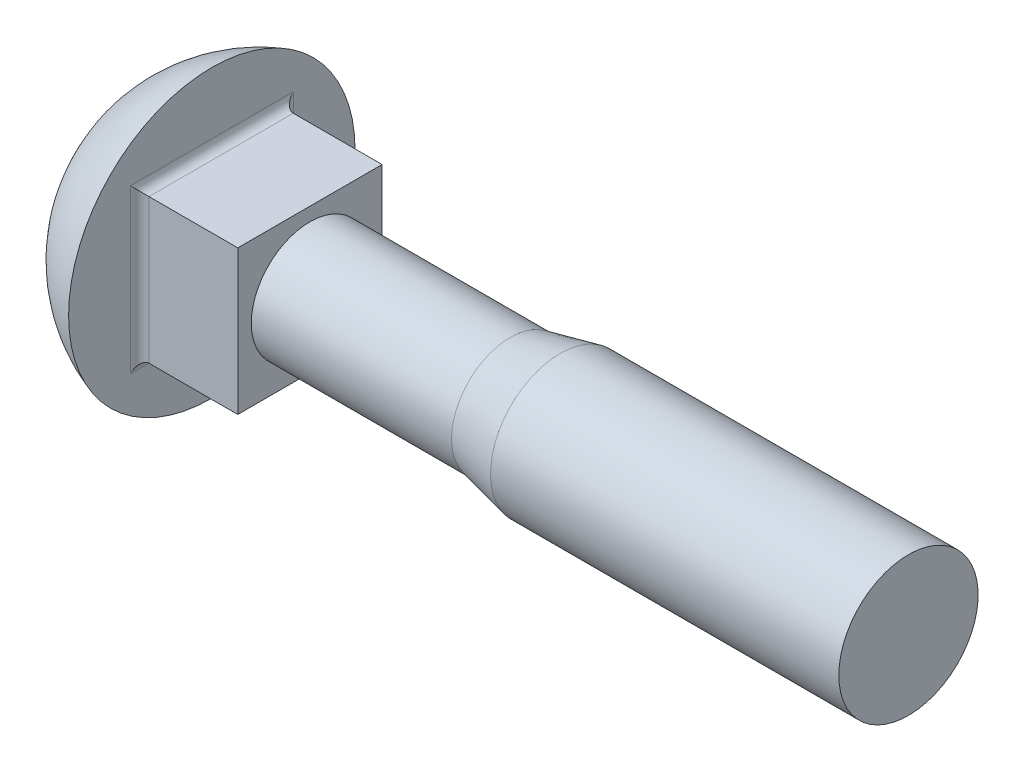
from build123d import *

# Parameters (mm, degrees)
SKETCH2_W    = 12.43
SKETCH2_H    = 12.43
NECK_DEPTH   = 8.45
HEADFILLET_R = 0.8


with BuildPart() as part:
    # Sketch1 → Base (revolve)
    with BuildSketch(Plane.XY, mode=Mode.PRIVATE) as base_sk:
        with BuildLine():
            Line((68.9, 0), (68.9, 6))
            Line((68.9, 6), (8.9, 6))
            Line((8.9, 6), (8.9, 12.336531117))
            ThreePointArc((8.9, 12.336531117), (2.457229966, 7.605918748), (0, 0))
            Line((0, 0), (68.9, 0))
        make_face()
    revolve(base_sk.sketch.rotate(Axis((-31.484345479, 0, 0), (1, 0, 0)), 90), axis=Axis((-31.484345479, 0, 0), (1, 0, 0)))

    # Sketch2 → Neck (add)
    with BuildSketch(Plane(origin=(8.9, 0, 0), x_dir=(0, 0, -1), z_dir=(1, 0, 0))):
        Rectangle(SKETCH2_W, SKETCH2_H)
    extrude(amount=NECK_DEPTH)

    # Sketch5 → Cut-Revolve1 (revolve, cut)
    with BuildSketch(Plane.XY, mode=Mode.PRIVATE) as cut_revolve1_sk:
        Polygon((17.35, 5.053), (34.6, 5.053), (38.9, 6), (17.35, 6), align=None)
    revolve(cut_revolve1_sk.sketch.rotate(Axis((0, 0, 0), (1, 0, 0)), 90), axis=Axis((0, 0, 0), (1, 0, 0)), mode=Mode.SUBTRACT)

    # HeadFillet
    headfillet_edges = [part.edges().sort_by_distance(p)[0] for p in [
        (8.9, -6.215, 0),
        (8.9, 0, -6.215),
        (8.9, 6.215, 0),
        (8.9, 0, 6.215),
    ]]
    fillet(headfillet_edges, radius=HEADFILLET_R)


solid = part.part
